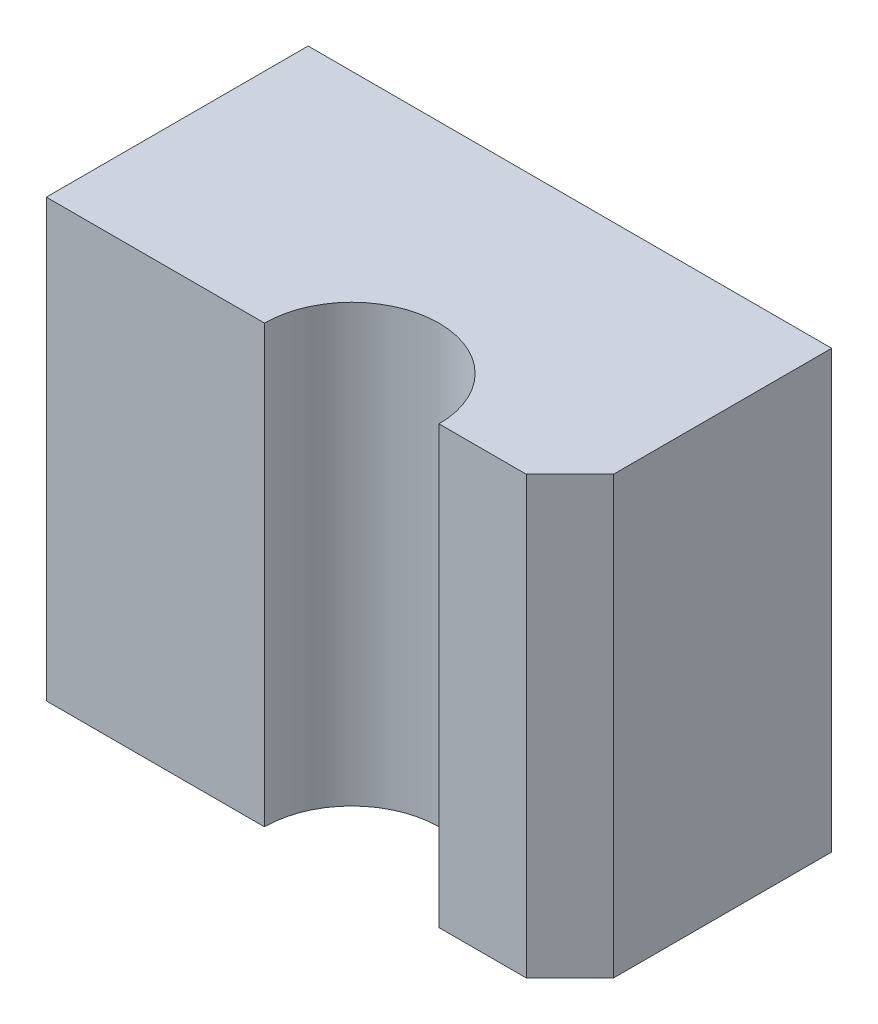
ISO-10303-21;
HEADER;
FILE_DESCRIPTION(('STEP AP214'),'2;1');
FILE_NAME('part.step','',(''),(''),'','','');
FILE_SCHEMA(('AUTOMOTIVE_DESIGN { 1 0 10303 214 1 1 1 1 }'));
ENDSEC;
DATA;
#1=APPLICATION_CONTEXT('core data for automotive mechanical design processes');
#2=APPLICATION_PROTOCOL_DEFINITION('international standard','automotive_design',2000,#1);
#3=PRODUCT_CONTEXT('',#1,'mechanical');
#4=PRODUCT('Part','Part','',(#3));
#5=PRODUCT_RELATED_PRODUCT_CATEGORY('part','',(#4));
#6=PRODUCT_DEFINITION_FORMATION('','',#4);
#7=PRODUCT_DEFINITION_CONTEXT('part definition',#1,'design');
#8=PRODUCT_DEFINITION('design','',#6,#7);
#9=PRODUCT_DEFINITION_SHAPE('','',#8);
#10=(LENGTH_UNIT() NAMED_UNIT(*) SI_UNIT(.MILLI.,.METRE.));
#11=(NAMED_UNIT(*) PLANE_ANGLE_UNIT() SI_UNIT($,.RADIAN.));
#12=(NAMED_UNIT(*) SI_UNIT($,.STERADIAN.) SOLID_ANGLE_UNIT());
#13=UNCERTAINTY_MEASURE_WITH_UNIT(LENGTH_MEASURE(1.E-05),#10,'distance_accuracy_value','');
#14=(GEOMETRIC_REPRESENTATION_CONTEXT(3) GLOBAL_UNCERTAINTY_ASSIGNED_CONTEXT((#13)) GLOBAL_UNIT_ASSIGNED_CONTEXT((#10,
#11,#12)) REPRESENTATION_CONTEXT('',''));
#15=CARTESIAN_POINT('',(0.,0.,0.));
#16=DIRECTION('',(0.,0.,1.));
#17=DIRECTION('',(1.,0.,0.));
#18=AXIS2_PLACEMENT_3D('',#15,#16,#17);
#19=CARTESIAN_POINT('',(0.,0.,60.));
#20=DIRECTION('',(0.,0.,-1.));
#21=DIRECTION('',(-1.,0.,0.));
#22=AXIS2_PLACEMENT_3D('',#19,#20,#21);
#23=PLANE('',#22);
#24=DIRECTION('',(1.,0.,0.));
#25=VECTOR('',#24,1.);
#26=CARTESIAN_POINT('',(0.,0.,60.));
#27=LINE('',#26,#25);
#28=CARTESIAN_POINT('',(90.,0.,60.));
#29=VERTEX_POINT('',#28);
#30=CARTESIAN_POINT('',(110.,0.,60.));
#31=VERTEX_POINT('',#30);
#32=EDGE_CURVE('E117',#29,#31,#27,.T.);
#33=ORIENTED_EDGE('',*,*,#32,.T.);
#34=DIRECTION('',(0.,1.,0.));
#35=VECTOR('',#34,1.);
#36=CARTESIAN_POINT('',(110.,0.,60.));
#37=LINE('',#36,#35);
#38=CARTESIAN_POINT('',(110.,100.,60.));
#39=VERTEX_POINT('',#38);
#40=EDGE_CURVE('E121',#31,#39,#37,.T.);
#41=ORIENTED_EDGE('',*,*,#40,.T.);
#42=DIRECTION('',(-1.,0.,0.));
#43=VECTOR('',#42,1.);
#44=CARTESIAN_POINT('',(0.,100.,60.));
#45=LINE('',#44,#43);
#46=CARTESIAN_POINT('',(90.,100.,60.));
#47=VERTEX_POINT('',#46);
#48=EDGE_CURVE('E119',#39,#47,#45,.T.);
#49=ORIENTED_EDGE('',*,*,#48,.T.);
#50=DIRECTION('',(0.,-1.,0.));
#51=VECTOR('',#50,1.);
#52=CARTESIAN_POINT('',(90.,100.,60.));
#53=LINE('',#52,#51);
#54=EDGE_CURVE('E104',#47,#29,#53,.T.);
#55=ORIENTED_EDGE('',*,*,#54,.T.);
#56=EDGE_LOOP('',(#33,#41,#49,#55));
#57=FACE_BOUND('',#56,.T.);
#58=ADVANCED_FACE('F42',(#57),#23,.F.);
#59=CARTESIAN_POINT('',(0.,0.,60.));
#60=DIRECTION('',(1.,0.,0.));
#61=DIRECTION('',(0.,0.,-1.));
#62=AXIS2_PLACEMENT_3D('',#59,#60,#61);
#63=PLANE('',#62);
#64=DIRECTION('',(0.,-1.,0.));
#65=VECTOR('',#64,1.);
#66=CARTESIAN_POINT('',(0.,0.,0.));
#67=LINE('',#66,#65);
#68=CARTESIAN_POINT('',(0.,100.,0.));
#69=VERTEX_POINT('',#68);
#70=CARTESIAN_POINT('',(0.,0.,0.));
#71=VERTEX_POINT('',#70);
#72=EDGE_CURVE('E139',#69,#71,#67,.T.);
#73=ORIENTED_EDGE('',*,*,#72,.T.);
#74=DIRECTION('',(0.,0.,-1.));
#75=VECTOR('',#74,1.);
#76=CARTESIAN_POINT('',(0.,0.,60.));
#77=LINE('',#76,#75);
#78=CARTESIAN_POINT('',(0.,0.,60.));
#79=VERTEX_POINT('',#78);
#80=EDGE_CURVE('E162',#79,#71,#77,.T.);
#81=ORIENTED_EDGE('',*,*,#80,.F.);
#82=DIRECTION('',(0.,-1.,0.));
#83=VECTOR('',#82,1.);
#84=CARTESIAN_POINT('',(0.,0.,60.));
#85=LINE('',#84,#83);
#86=CARTESIAN_POINT('',(0.,100.,60.));
#87=VERTEX_POINT('',#86);
#88=EDGE_CURVE('E127',#87,#79,#85,.T.);
#89=ORIENTED_EDGE('',*,*,#88,.F.);
#90=DIRECTION('',(0.,0.,-1.));
#91=VECTOR('',#90,1.);
#92=CARTESIAN_POINT('',(0.,100.,60.));
#93=LINE('',#92,#91);
#94=EDGE_CURVE('E138',#87,#69,#93,.T.);
#95=ORIENTED_EDGE('',*,*,#94,.T.);
#96=EDGE_LOOP('',(#73,#81,#89,#95));
#97=FACE_BOUND('',#96,.T.);
#98=ADVANCED_FACE('F183',(#97),#63,.F.);
#99=CARTESIAN_POINT('',(0.,0.,60.));
#100=DIRECTION('',(0.,1.,0.));
#101=DIRECTION('',(0.,0.,1.));
#102=AXIS2_PLACEMENT_3D('',#99,#100,#101);
#103=PLANE('',#102);
#104=DIRECTION('',(0.,0.,-1.));
#105=VECTOR('',#104,1.);
#106=CARTESIAN_POINT('',(120.,0.,60.));
#107=LINE('',#106,#105);
#108=CARTESIAN_POINT('',(120.,0.,50.));
#109=VERTEX_POINT('',#108);
#110=CARTESIAN_POINT('',(120.,0.,0.));
#111=VERTEX_POINT('',#110);
#112=EDGE_CURVE('E159',#109,#111,#107,.T.);
#113=ORIENTED_EDGE('',*,*,#112,.F.);
#114=DIRECTION('',(0.707106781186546,0.,-0.707106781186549));
#115=VECTOR('',#114,1.);
#116=CARTESIAN_POINT('',(110.,0.,60.));
#117=LINE('',#116,#115);
#118=EDGE_CURVE('E11',#109,#31,#117,.F.);
#119=ORIENTED_EDGE('',*,*,#118,.T.);
#120=ORIENTED_EDGE('',*,*,#32,.F.);
#121=CARTESIAN_POINT('',(70.,0.,60.));
#122=DIRECTION('',(0.,-1.,0.));
#123=DIRECTION('',(0.,0.,-1.));
#124=AXIS2_PLACEMENT_3D('',#121,#122,#123);
#125=CIRCLE('',#124,20.);
#126=CARTESIAN_POINT('',(50.,0.,60.));
#127=VERTEX_POINT('',#126);
#128=EDGE_CURVE('E101',#127,#29,#125,.T.);
#129=ORIENTED_EDGE('',*,*,#128,.F.);
#130=EDGE_CURVE('E126',#79,#127,#27,.T.);
#131=ORIENTED_EDGE('',*,*,#130,.F.);
#132=ORIENTED_EDGE('',*,*,#80,.T.);
#133=DIRECTION('',(1.,0.,0.));
#134=VECTOR('',#133,1.);
#135=CARTESIAN_POINT('',(0.,0.,0.));
#136=LINE('',#135,#134);
#137=EDGE_CURVE('E143',#71,#111,#136,.T.);
#138=ORIENTED_EDGE('',*,*,#137,.T.);
#139=EDGE_LOOP('',(#113,#119,#120,#129,#131,#132,#138));
#140=FACE_BOUND('',#139,.T.);
#141=ADVANCED_FACE('F123',(#140),#103,.F.);
#142=CARTESIAN_POINT('',(120.,0.,60.));
#143=DIRECTION('',(-1.,0.,0.));
#144=DIRECTION('',(0.,0.,1.));
#145=AXIS2_PLACEMENT_3D('',#142,#143,#144);
#146=PLANE('',#145);
#147=DIRECTION('',(0.,0.,-1.));
#148=VECTOR('',#147,1.);
#149=CARTESIAN_POINT('',(120.,100.,60.));
#150=LINE('',#149,#148);
#151=CARTESIAN_POINT('',(120.,100.,50.));
#152=VERTEX_POINT('',#151);
#153=CARTESIAN_POINT('',(120.,100.,0.));
#154=VERTEX_POINT('',#153);
#155=EDGE_CURVE('E156',#152,#154,#150,.T.);
#156=ORIENTED_EDGE('',*,*,#155,.F.);
#157=DIRECTION('',(0.,-1.,0.));
#158=VECTOR('',#157,1.);
#159=CARTESIAN_POINT('',(120.,0.,50.));
#160=LINE('',#159,#158);
#161=EDGE_CURVE('E52',#152,#109,#160,.T.);
#162=ORIENTED_EDGE('',*,*,#161,.T.);
#163=ORIENTED_EDGE('',*,*,#112,.T.);
#164=DIRECTION('',(0.,1.,0.));
#165=VECTOR('',#164,1.);
#166=CARTESIAN_POINT('',(120.,0.,0.));
#167=LINE('',#166,#165);
#168=EDGE_CURVE('E147',#111,#154,#167,.T.);
#169=ORIENTED_EDGE('',*,*,#168,.T.);
#170=EDGE_LOOP('',(#156,#162,#163,#169));
#171=FACE_BOUND('',#170,.T.);
#172=ADVANCED_FACE('F187',(#171),#146,.F.);
#173=CARTESIAN_POINT('',(0.,100.,60.));
#174=DIRECTION('',(0.,-1.,0.));
#175=DIRECTION('',(0.,0.,-1.));
#176=AXIS2_PLACEMENT_3D('',#173,#174,#175);
#177=PLANE('',#176);
#178=ORIENTED_EDGE('',*,*,#48,.F.);
#179=DIRECTION('',(-0.707106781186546,0.,0.707106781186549));
#180=VECTOR('',#179,1.);
#181=CARTESIAN_POINT('',(110.,100.,60.));
#182=LINE('',#181,#180);
#183=EDGE_CURVE('E66',#39,#152,#182,.F.);
#184=ORIENTED_EDGE('',*,*,#183,.T.);
#185=ORIENTED_EDGE('',*,*,#155,.T.);
#186=DIRECTION('',(-1.,0.,0.));
#187=VECTOR('',#186,1.);
#188=CARTESIAN_POINT('',(0.,100.,0.));
#189=LINE('',#188,#187);
#190=EDGE_CURVE('E133',#154,#69,#189,.T.);
#191=ORIENTED_EDGE('',*,*,#190,.T.);
#192=ORIENTED_EDGE('',*,*,#94,.F.);
#193=CARTESIAN_POINT('',(50.,100.,60.));
#194=VERTEX_POINT('',#193);
#195=EDGE_CURVE('E131',#194,#87,#45,.T.);
#196=ORIENTED_EDGE('',*,*,#195,.F.);
#197=CARTESIAN_POINT('',(70.,100.,60.));
#198=DIRECTION('',(0.,-1.,0.));
#199=DIRECTION('',(0.,0.,-1.));
#200=AXIS2_PLACEMENT_3D('',#197,#198,#199);
#201=CIRCLE('',#200,20.);
#202=EDGE_CURVE('E112',#194,#47,#201,.T.);
#203=ORIENTED_EDGE('',*,*,#202,.T.);
#204=EDGE_LOOP('',(#178,#184,#185,#191,#192,#196,#203));
#205=FACE_BOUND('',#204,.T.);
#206=ADVANCED_FACE('F179',(#205),#177,.F.);
#207=ORIENTED_EDGE('',*,*,#130,.T.);
#208=DIRECTION('',(0.,-1.,0.));
#209=VECTOR('',#208,1.);
#210=CARTESIAN_POINT('',(50.,100.,60.));
#211=LINE('',#210,#209);
#212=EDGE_CURVE('E107',#127,#194,#211,.F.);
#213=ORIENTED_EDGE('',*,*,#212,.T.);
#214=ORIENTED_EDGE('',*,*,#195,.T.);
#215=ORIENTED_EDGE('',*,*,#88,.T.);
#216=EDGE_LOOP('',(#207,#213,#214,#215));
#217=FACE_BOUND('',#216,.T.);
#218=ADVANCED_FACE('F176',(#217),#23,.F.);
#219=CARTESIAN_POINT('',(0.,0.,0.));
#220=DIRECTION('',(0.,0.,-1.));
#221=DIRECTION('',(-1.,0.,0.));
#222=AXIS2_PLACEMENT_3D('',#219,#220,#221);
#223=PLANE('',#222);
#224=ORIENTED_EDGE('',*,*,#72,.F.);
#225=ORIENTED_EDGE('',*,*,#190,.F.);
#226=ORIENTED_EDGE('',*,*,#168,.F.);
#227=ORIENTED_EDGE('',*,*,#137,.F.);
#228=EDGE_LOOP('',(#224,#225,#226,#227));
#229=FACE_BOUND('',#228,.T.);
#230=ADVANCED_FACE('F186',(#229),#223,.T.);
#231=CARTESIAN_POINT('',(70.,100.,60.));
#232=DIRECTION('',(0.,-1.,0.));
#233=DIRECTION('',(0.,0.,-1.));
#234=AXIS2_PLACEMENT_3D('',#231,#232,#233);
#235=CYLINDRICAL_SURFACE('',#234,20.);
#236=ORIENTED_EDGE('',*,*,#202,.F.);
#237=ORIENTED_EDGE('',*,*,#212,.F.);
#238=ORIENTED_EDGE('',*,*,#128,.T.);
#239=ORIENTED_EDGE('',*,*,#54,.F.);
#240=EDGE_LOOP('',(#236,#237,#238,#239));
#241=FACE_BOUND('',#240,.T.);
#242=ADVANCED_FACE('F103',(#241),#235,.F.);
#243=CARTESIAN_POINT('',(110.,0.,60.));
#244=DIRECTION('',(-0.707106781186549,0.,-0.707106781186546));
#245=DIRECTION('',(0.,1.,0.));
#246=AXIS2_PLACEMENT_3D('',#243,#244,#245);
#247=PLANE('',#246);
#248=ORIENTED_EDGE('',*,*,#118,.F.);
#249=ORIENTED_EDGE('',*,*,#161,.F.);
#250=ORIENTED_EDGE('',*,*,#183,.F.);
#251=ORIENTED_EDGE('',*,*,#40,.F.);
#252=EDGE_LOOP('',(#248,#249,#250,#251));
#253=FACE_BOUND('',#252,.T.);
#254=ADVANCED_FACE('F45',(#253),#247,.F.);
#255=CLOSED_SHELL('',(#58,#98,#141,#172,#206,#218,#230,#242,#254));
#256=MANIFOLD_SOLID_BREP('B2',#255);
#257=ADVANCED_BREP_SHAPE_REPRESENTATION('',(#18,#256),#14);
#258=SHAPE_DEFINITION_REPRESENTATION(#9,#257);
ENDSEC;
END-ISO-10303-21;
